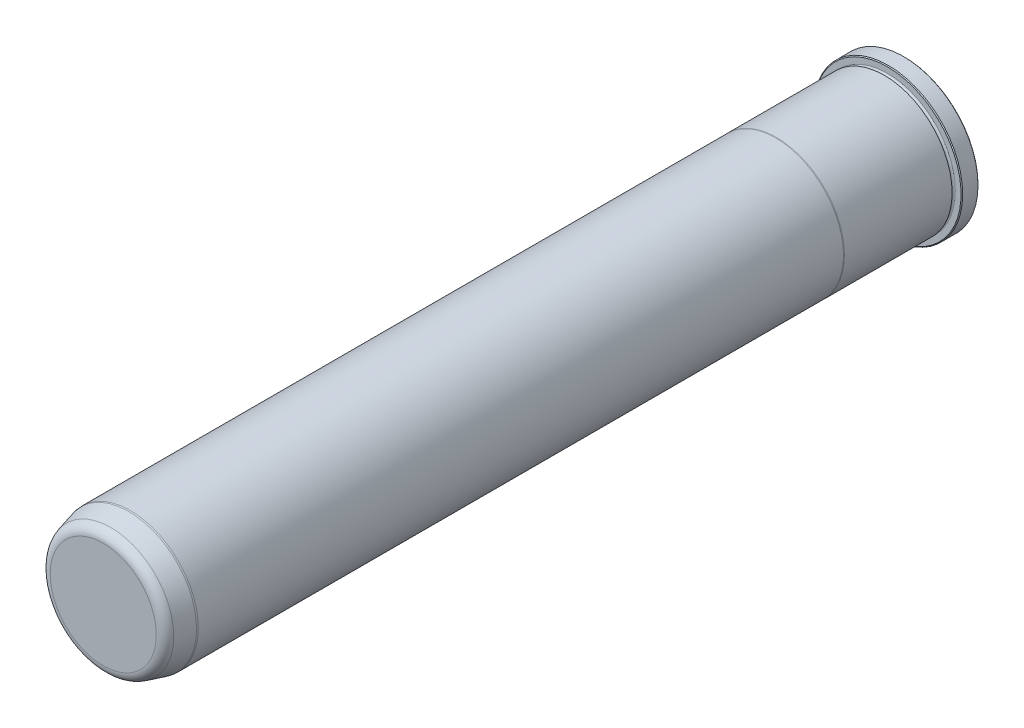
from build123d import *

# Parameters (mm, degrees)
FILLET6_R     = 4.7625
CHAMFER1_SIZE = 0.381


with BuildPart() as part:
    # Sketch1 → Revolve1 (revolve)
    with BuildSketch(Plane(origin=(0, 0, 0), x_dir=(0, 0, -1), z_dir=(1, 0, 0)), mode=Mode.PRIVATE) as revolve1_sk:
        with BuildLine():
            Line((0, 0), (0, 34.798))
            Line((0, 34.798), (-7.9248, 34.798))
            Line((-7.9248, 34.798), (-7.9248, 31.7373))
            ThreePointArc((-7.9248, 31.7373), (-8.6868, 30.9753), (-9.4488, 31.7373))
            Line((-9.4488, 31.7373), (-9.4488, 31.7627))
            Line((-9.4488, 31.7627), (-59.834763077, 31.7627))
            Line((-59.834763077, 31.7627), (-60.198, 31.7373))
            Line((-60.198, 31.7373), (-361.95, 31.7373))
            Line((-361.95, 31.7373), (-362.712, 31.670633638))
            Line((-362.712, 31.670633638), (-374.65, 28.471856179))
            Line((-374.65, 28.471856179), (-374.65, 0))
            Line((-374.65, 0), (0, 0))
        make_face()
    revolve(revolve1_sk.sketch.rotate(Axis((0, 0, 0), (0, 0, -1)), 90), axis=Axis((0, 0, 0), (0, 0, -1)))

    # Fillet6
    fillet6_edges = [part.edges().sort_by_distance(p)[0] for p in [
        (-28.471856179, 0, 374.65),
    ]]
    fillet(fillet6_edges, radius=FILLET6_R)

    # Chamfer1
    chamfer1_edges = [part.edges().sort_by_distance(p)[0] for p in [
        (-34.798, 0, 7.9248),
        (-34.798, 0, 0),
    ]]
    chamfer(chamfer1_edges, length=CHAMFER1_SIZE)


solid = part.part
